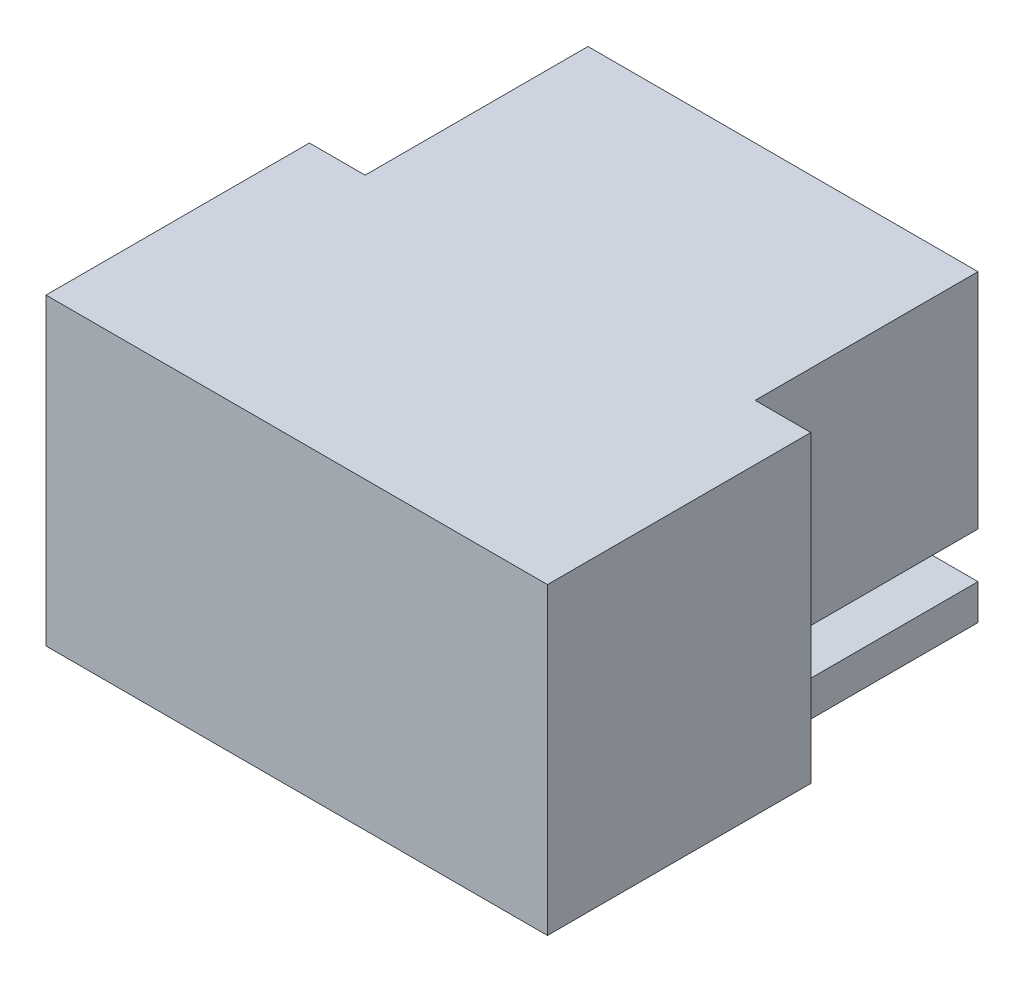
ISO-10303-21;
HEADER;
FILE_DESCRIPTION(('STEP AP214'),'2;1');
FILE_NAME('part.step','',(''),(''),'','','');
FILE_SCHEMA(('AUTOMOTIVE_DESIGN { 1 0 10303 214 1 1 1 1 }'));
ENDSEC;
DATA;
#1=APPLICATION_CONTEXT('core data for automotive mechanical design processes');
#2=APPLICATION_PROTOCOL_DEFINITION('international standard','automotive_design',2000,#1);
#3=PRODUCT_CONTEXT('',#1,'mechanical');
#4=PRODUCT('Part','Part','',(#3));
#5=PRODUCT_RELATED_PRODUCT_CATEGORY('part','',(#4));
#6=PRODUCT_DEFINITION_FORMATION('','',#4);
#7=PRODUCT_DEFINITION_CONTEXT('part definition',#1,'design');
#8=PRODUCT_DEFINITION('design','',#6,#7);
#9=PRODUCT_DEFINITION_SHAPE('','',#8);
#10=(LENGTH_UNIT() NAMED_UNIT(*) SI_UNIT(.MILLI.,.METRE.));
#11=(NAMED_UNIT(*) PLANE_ANGLE_UNIT() SI_UNIT($,.RADIAN.));
#12=(NAMED_UNIT(*) SI_UNIT($,.STERADIAN.) SOLID_ANGLE_UNIT());
#13=UNCERTAINTY_MEASURE_WITH_UNIT(LENGTH_MEASURE(1.E-05),#10,'distance_accuracy_value','');
#14=(GEOMETRIC_REPRESENTATION_CONTEXT(3) GLOBAL_UNCERTAINTY_ASSIGNED_CONTEXT((#13)) GLOBAL_UNIT_ASSIGNED_CONTEXT((#10,
#11,#12)) REPRESENTATION_CONTEXT('',''));
#15=CARTESIAN_POINT('',(0.,0.,0.));
#16=DIRECTION('',(0.,0.,1.));
#17=DIRECTION('',(1.,0.,0.));
#18=AXIS2_PLACEMENT_3D('',#15,#16,#17);
#19=CARTESIAN_POINT('',(-22.15,-25.085,-8.70710678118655));
#20=DIRECTION('',(1.,0.,0.));
#21=DIRECTION('',(0.,0.,-1.));
#22=AXIS2_PLACEMENT_3D('',#19,#20,#21);
#23=PLANE('',#22);
#24=DIRECTION('',(0.,0.,1.));
#25=VECTOR('',#24,1.);
#26=CARTESIAN_POINT('',(-22.15,-25.585,-8.70710678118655));
#27=LINE('',#26,#25);
#28=CARTESIAN_POINT('',(-22.15,-25.585,-6.7));
#29=VERTEX_POINT('',#28);
#30=CARTESIAN_POINT('',(-22.15,-25.585,-3.));
#31=VERTEX_POINT('',#30);
#32=EDGE_CURVE('E225',#29,#31,#27,.T.);
#33=ORIENTED_EDGE('',*,*,#32,.T.);
#34=DIRECTION('',(0.,1.,0.));
#35=VECTOR('',#34,1.);
#36=CARTESIAN_POINT('',(-22.15,-25.085,-3.));
#37=LINE('',#36,#35);
#38=CARTESIAN_POINT('',(-22.15,-25.085,-3.));
#39=VERTEX_POINT('',#38);
#40=EDGE_CURVE('E20',#39,#31,#37,.F.);
#41=ORIENTED_EDGE('',*,*,#40,.F.);
#42=DIRECTION('',(0.,0.,-1.));
#43=VECTOR('',#42,1.);
#44=CARTESIAN_POINT('',(-22.15,-25.085,-8.70710678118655));
#45=LINE('',#44,#43);
#46=CARTESIAN_POINT('',(-22.15,-25.085,-6.7));
#47=VERTEX_POINT('',#46);
#48=EDGE_CURVE('E243',#39,#47,#45,.T.);
#49=ORIENTED_EDGE('',*,*,#48,.T.);
#50=DIRECTION('',(0.,1.,0.));
#51=VECTOR('',#50,1.);
#52=CARTESIAN_POINT('',(-22.15,-25.085,-6.7));
#53=LINE('',#52,#51);
#54=EDGE_CURVE('E220',#29,#47,#53,.T.);
#55=ORIENTED_EDGE('',*,*,#54,.F.);
#56=EDGE_LOOP('',(#33,#41,#49,#55));
#57=FACE_BOUND('',#56,.T.);
#58=ADVANCED_FACE('F17',(#57),#23,.F.);
#59=CARTESIAN_POINT('',(-24.5,-25.085,-8.70710678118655));
#60=DIRECTION('',(1.,0.,0.));
#61=DIRECTION('',(0.,0.,-1.));
#62=AXIS2_PLACEMENT_3D('',#59,#60,#61);
#63=PLANE('',#62);
#64=DIRECTION('',(0.,0.,1.));
#65=VECTOR('',#64,1.);
#66=CARTESIAN_POINT('',(-24.5,-25.585,-8.70710678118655));
#67=LINE('',#66,#65);
#68=CARTESIAN_POINT('',(-24.5,-25.585,-6.7));
#69=VERTEX_POINT('',#68);
#70=CARTESIAN_POINT('',(-24.5,-25.585,-3.));
#71=VERTEX_POINT('',#70);
#72=EDGE_CURVE('E251',#69,#71,#67,.T.);
#73=ORIENTED_EDGE('',*,*,#72,.T.);
#74=DIRECTION('',(0.,1.,0.));
#75=VECTOR('',#74,1.);
#76=CARTESIAN_POINT('',(-24.5,-25.085,-3.));
#77=LINE('',#76,#75);
#78=CARTESIAN_POINT('',(-24.5,-25.085,-3.));
#79=VERTEX_POINT('',#78);
#80=EDGE_CURVE('E232',#79,#71,#77,.F.);
#81=ORIENTED_EDGE('',*,*,#80,.F.);
#82=DIRECTION('',(0.,0.,-1.));
#83=VECTOR('',#82,1.);
#84=CARTESIAN_POINT('',(-24.5,-25.085,-8.70710678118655));
#85=LINE('',#84,#83);
#86=CARTESIAN_POINT('',(-24.5,-25.085,-6.7));
#87=VERTEX_POINT('',#86);
#88=EDGE_CURVE('E261',#79,#87,#85,.T.);
#89=ORIENTED_EDGE('',*,*,#88,.T.);
#90=DIRECTION('',(0.,1.,0.));
#91=VECTOR('',#90,1.);
#92=CARTESIAN_POINT('',(-24.5,-25.085,-6.7));
#93=LINE('',#92,#91);
#94=EDGE_CURVE('E230',#69,#87,#93,.T.);
#95=ORIENTED_EDGE('',*,*,#94,.F.);
#96=EDGE_LOOP('',(#73,#81,#89,#95));
#97=FACE_BOUND('',#96,.T.);
#98=ADVANCED_FACE('F607',(#97),#63,.F.);
#99=CARTESIAN_POINT('',(-21.65,-25.585,-8.70710678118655));
#100=DIRECTION('',(0.,1.,0.));
#101=DIRECTION('',(0.,0.,1.));
#102=AXIS2_PLACEMENT_3D('',#99,#100,#101);
#103=PLANE('',#102);
#104=DIRECTION('',(0.,0.,1.));
#105=VECTOR('',#104,1.);
#106=CARTESIAN_POINT('',(-21.65,-25.585,-8.70710678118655));
#107=LINE('',#106,#105);
#108=CARTESIAN_POINT('',(-21.65,-25.585,-6.7));
#109=VERTEX_POINT('',#108);
#110=CARTESIAN_POINT('',(-21.65,-25.585,-3.));
#111=VERTEX_POINT('',#110);
#112=EDGE_CURVE('E227',#109,#111,#107,.T.);
#113=ORIENTED_EDGE('',*,*,#112,.T.);
#114=DIRECTION('',(1.,0.,0.));
#115=VECTOR('',#114,1.);
#116=CARTESIAN_POINT('',(-21.65,-25.585,-3.));
#117=LINE('',#116,#115);
#118=EDGE_CURVE('E217',#31,#111,#117,.T.);
#119=ORIENTED_EDGE('',*,*,#118,.F.);
#120=ORIENTED_EDGE('',*,*,#32,.F.);
#121=DIRECTION('',(-1.,0.,0.));
#122=VECTOR('',#121,1.);
#123=CARTESIAN_POINT('',(0.,-25.585,-6.7));
#124=LINE('',#123,#122);
#125=EDGE_CURVE('E242',#109,#29,#124,.T.);
#126=ORIENTED_EDGE('',*,*,#125,.F.);
#127=EDGE_LOOP('',(#113,#119,#120,#126));
#128=FACE_BOUND('',#127,.T.);
#129=ADVANCED_FACE('F223',(#128),#103,.F.);
#130=CARTESIAN_POINT('',(-21.65,-25.085,-8.70710678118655));
#131=DIRECTION('',(0.,-1.,0.));
#132=DIRECTION('',(0.,0.,-1.));
#133=AXIS2_PLACEMENT_3D('',#130,#131,#132);
#134=PLANE('',#133);
#135=ORIENTED_EDGE('',*,*,#48,.F.);
#136=DIRECTION('',(1.,0.,0.));
#137=VECTOR('',#136,1.);
#138=CARTESIAN_POINT('',(-21.65,-25.085,-3.));
#139=LINE('',#138,#137);
#140=CARTESIAN_POINT('',(-21.65,-25.085,-3.));
#141=VERTEX_POINT('',#140);
#142=EDGE_CURVE('E219',#141,#39,#139,.F.);
#143=ORIENTED_EDGE('',*,*,#142,.F.);
#144=DIRECTION('',(0.,0.,1.));
#145=VECTOR('',#144,1.);
#146=CARTESIAN_POINT('',(-21.65,-25.085,-8.70710678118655));
#147=LINE('',#146,#145);
#148=CARTESIAN_POINT('',(-21.65,-25.085,-6.7));
#149=VERTEX_POINT('',#148);
#150=EDGE_CURVE('E249',#141,#149,#147,.F.);
#151=ORIENTED_EDGE('',*,*,#150,.T.);
#152=DIRECTION('',(-1.,0.,0.));
#153=VECTOR('',#152,1.);
#154=CARTESIAN_POINT('',(0.,-25.085,-6.7));
#155=LINE('',#154,#153);
#156=EDGE_CURVE('E240',#47,#149,#155,.F.);
#157=ORIENTED_EDGE('',*,*,#156,.F.);
#158=EDGE_LOOP('',(#135,#143,#151,#157));
#159=FACE_BOUND('',#158,.T.);
#160=ADVANCED_FACE('F247',(#159),#134,.F.);
#161=CARTESIAN_POINT('',(0.,0.,-6.7));
#162=DIRECTION('',(0.,0.,-1.));
#163=DIRECTION('',(-1.,0.,0.));
#164=AXIS2_PLACEMENT_3D('',#161,#162,#163);
#165=PLANE('',#164);
#166=ORIENTED_EDGE('',*,*,#125,.T.);
#167=ORIENTED_EDGE('',*,*,#54,.T.);
#168=ORIENTED_EDGE('',*,*,#156,.T.);
#169=DIRECTION('',(0.,1.,0.));
#170=VECTOR('',#169,1.);
#171=CARTESIAN_POINT('',(-21.65,-25.085,-6.7));
#172=LINE('',#171,#170);
#173=EDGE_CURVE('E271',#149,#109,#172,.F.);
#174=ORIENTED_EDGE('',*,*,#173,.T.);
#175=EDGE_LOOP('',(#166,#167,#168,#174));
#176=FACE_BOUND('',#175,.T.);
#177=ADVANCED_FACE('F237',(#176),#165,.T.);
#178=CARTESIAN_POINT('',(-24.,-25.585,-8.70710678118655));
#179=DIRECTION('',(0.,1.,0.));
#180=DIRECTION('',(0.,0.,1.));
#181=AXIS2_PLACEMENT_3D('',#178,#179,#180);
#182=PLANE('',#181);
#183=DIRECTION('',(0.,0.,1.));
#184=VECTOR('',#183,1.);
#185=CARTESIAN_POINT('',(-24.,-25.585,-8.70710678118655));
#186=LINE('',#185,#184);
#187=CARTESIAN_POINT('',(-24.,-25.585,-6.7));
#188=VERTEX_POINT('',#187);
#189=CARTESIAN_POINT('',(-24.,-25.585,-3.));
#190=VERTEX_POINT('',#189);
#191=EDGE_CURVE('E273',#188,#190,#186,.T.);
#192=ORIENTED_EDGE('',*,*,#191,.T.);
#193=DIRECTION('',(1.,0.,0.));
#194=VECTOR('',#193,1.);
#195=CARTESIAN_POINT('',(-24.,-25.585,-3.));
#196=LINE('',#195,#194);
#197=EDGE_CURVE('E256',#71,#190,#196,.T.);
#198=ORIENTED_EDGE('',*,*,#197,.F.);
#199=ORIENTED_EDGE('',*,*,#72,.F.);
#200=DIRECTION('',(-1.,0.,0.));
#201=VECTOR('',#200,1.);
#202=CARTESIAN_POINT('',(0.,-25.585,-6.7));
#203=LINE('',#202,#201);
#204=EDGE_CURVE('E266',#188,#69,#203,.T.);
#205=ORIENTED_EDGE('',*,*,#204,.F.);
#206=EDGE_LOOP('',(#192,#198,#199,#205));
#207=FACE_BOUND('',#206,.T.);
#208=ADVANCED_FACE('F597',(#207),#182,.F.);
#209=CARTESIAN_POINT('',(-24.,-25.085,-8.70710678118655));
#210=DIRECTION('',(0.,-1.,0.));
#211=DIRECTION('',(0.,0.,-1.));
#212=AXIS2_PLACEMENT_3D('',#209,#210,#211);
#213=PLANE('',#212);
#214=ORIENTED_EDGE('',*,*,#88,.F.);
#215=DIRECTION('',(1.,0.,0.));
#216=VECTOR('',#215,1.);
#217=CARTESIAN_POINT('',(-24.,-25.085,-3.));
#218=LINE('',#217,#216);
#219=CARTESIAN_POINT('',(-24.,-25.085,-3.));
#220=VERTEX_POINT('',#219);
#221=EDGE_CURVE('E258',#220,#79,#218,.F.);
#222=ORIENTED_EDGE('',*,*,#221,.F.);
#223=DIRECTION('',(0.,0.,1.));
#224=VECTOR('',#223,1.);
#225=CARTESIAN_POINT('',(-24.,-25.085,-8.70710678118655));
#226=LINE('',#225,#224);
#227=CARTESIAN_POINT('',(-24.,-25.085,-6.7));
#228=VERTEX_POINT('',#227);
#229=EDGE_CURVE('E276',#220,#228,#226,.F.);
#230=ORIENTED_EDGE('',*,*,#229,.T.);
#231=DIRECTION('',(-1.,0.,0.));
#232=VECTOR('',#231,1.);
#233=CARTESIAN_POINT('',(0.,-25.085,-6.7));
#234=LINE('',#233,#232);
#235=EDGE_CURVE('E264',#87,#228,#234,.F.);
#236=ORIENTED_EDGE('',*,*,#235,.F.);
#237=EDGE_LOOP('',(#214,#222,#230,#236));
#238=FACE_BOUND('',#237,.T.);
#239=ADVANCED_FACE('F593',(#238),#213,.F.);
#240=CARTESIAN_POINT('',(0.,0.,-6.7));
#241=DIRECTION('',(0.,0.,-1.));
#242=DIRECTION('',(-1.,0.,0.));
#243=AXIS2_PLACEMENT_3D('',#240,#241,#242);
#244=PLANE('',#243);
#245=ORIENTED_EDGE('',*,*,#204,.T.);
#246=ORIENTED_EDGE('',*,*,#94,.T.);
#247=ORIENTED_EDGE('',*,*,#235,.T.);
#248=DIRECTION('',(0.,1.,0.));
#249=VECTOR('',#248,1.);
#250=CARTESIAN_POINT('',(-24.,-25.085,-6.7));
#251=LINE('',#250,#249);
#252=EDGE_CURVE('E279',#228,#188,#251,.F.);
#253=ORIENTED_EDGE('',*,*,#252,.T.);
#254=EDGE_LOOP('',(#245,#246,#247,#253));
#255=FACE_BOUND('',#254,.T.);
#256=ADVANCED_FACE('F589',(#255),#244,.T.);
#257=CARTESIAN_POINT('',(-21.65,-25.085,-8.70710678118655));
#258=DIRECTION('',(-1.,0.,0.));
#259=DIRECTION('',(0.,0.,1.));
#260=AXIS2_PLACEMENT_3D('',#257,#258,#259);
#261=PLANE('',#260);
#262=ORIENTED_EDGE('',*,*,#150,.F.);
#263=DIRECTION('',(0.,1.,0.));
#264=VECTOR('',#263,1.);
#265=CARTESIAN_POINT('',(-21.65,0.,-3.));
#266=LINE('',#265,#264);
#267=EDGE_CURVE('E304',#141,#111,#266,.F.);
#268=ORIENTED_EDGE('',*,*,#267,.T.);
#269=ORIENTED_EDGE('',*,*,#112,.F.);
#270=ORIENTED_EDGE('',*,*,#173,.F.);
#271=EDGE_LOOP('',(#262,#268,#269,#270));
#272=FACE_BOUND('',#271,.T.);
#273=ADVANCED_FACE('F585',(#272),#261,.F.);
#274=CARTESIAN_POINT('',(-19.9534322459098,-26.485,-3.));
#275=DIRECTION('',(0.,-1.,0.));
#276=DIRECTION('',(0.,0.,-1.));
#277=AXIS2_PLACEMENT_3D('',#274,#275,#276);
#278=PLANE('',#277);
#279=DIRECTION('',(0.,0.,-1.));
#280=VECTOR('',#279,1.);
#281=CARTESIAN_POINT('',(-21.15,-26.485,-3.));
#282=LINE('',#281,#280);
#283=CARTESIAN_POINT('',(-21.15,-26.485,-8.));
#284=VERTEX_POINT('',#283);
#285=CARTESIAN_POINT('',(-21.15,-26.485,-3.));
#286=VERTEX_POINT('',#285);
#287=EDGE_CURVE('E299',#284,#286,#282,.F.);
#288=ORIENTED_EDGE('',*,*,#287,.T.);
#289=DIRECTION('',(1.,0.,0.));
#290=VECTOR('',#289,1.);
#291=CARTESIAN_POINT('',(0.,-26.485,-3.));
#292=LINE('',#291,#290);
#293=CARTESIAN_POINT('',(-19.1,-26.485,-3.));
#294=VERTEX_POINT('',#293);
#295=EDGE_CURVE('E311',#286,#294,#292,.T.);
#296=ORIENTED_EDGE('',*,*,#295,.T.);
#297=DIRECTION('',(0.,0.,-1.));
#298=VECTOR('',#297,1.);
#299=CARTESIAN_POINT('',(-19.1,-26.485,-3.));
#300=LINE('',#299,#298);
#301=CARTESIAN_POINT('',(-19.1,-26.485,-3.6));
#302=VERTEX_POINT('',#301);
#303=EDGE_CURVE('E284',#294,#302,#300,.T.);
#304=ORIENTED_EDGE('',*,*,#303,.T.);
#305=DIRECTION('',(0.,0.,1.));
#306=VECTOR('',#305,1.);
#307=CARTESIAN_POINT('',(-19.1,-26.485,-3.6));
#308=LINE('',#307,#306);
#309=CARTESIAN_POINT('',(-19.1,-26.485,-8.));
#310=VERTEX_POINT('',#309);
#311=EDGE_CURVE('E292',#302,#310,#308,.F.);
#312=ORIENTED_EDGE('',*,*,#311,.T.);
#313=DIRECTION('',(-1.,0.,0.));
#314=VECTOR('',#313,1.);
#315=CARTESIAN_POINT('',(0.,-26.485,-8.));
#316=LINE('',#315,#314);
#317=EDGE_CURVE('E295',#284,#310,#316,.F.);
#318=ORIENTED_EDGE('',*,*,#317,.F.);
#319=EDGE_LOOP('',(#288,#296,#304,#312,#318));
#320=FACE_BOUND('',#319,.T.);
#321=ADVANCED_FACE('F581',(#320),#278,.F.);
#322=CARTESIAN_POINT('',(-24.,-25.085,-8.70710678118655));
#323=DIRECTION('',(-1.,0.,0.));
#324=DIRECTION('',(0.,0.,1.));
#325=AXIS2_PLACEMENT_3D('',#322,#323,#324);
#326=PLANE('',#325);
#327=ORIENTED_EDGE('',*,*,#229,.F.);
#328=DIRECTION('',(0.,1.,0.));
#329=VECTOR('',#328,1.);
#330=CARTESIAN_POINT('',(-24.,0.,-3.));
#331=LINE('',#330,#329);
#332=EDGE_CURVE('E316',#220,#190,#331,.F.);
#333=ORIENTED_EDGE('',*,*,#332,.T.);
#334=ORIENTED_EDGE('',*,*,#191,.F.);
#335=ORIENTED_EDGE('',*,*,#252,.F.);
#336=EDGE_LOOP('',(#327,#333,#334,#335));
#337=FACE_BOUND('',#336,.T.);
#338=ADVANCED_FACE('F577',(#337),#326,.F.);
#339=CARTESIAN_POINT('',(-25.9465677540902,-26.485,-3.));
#340=DIRECTION('',(0.,-1.,0.));
#341=DIRECTION('',(0.,0.,-1.));
#342=AXIS2_PLACEMENT_3D('',#339,#340,#341);
#343=PLANE('',#342);
#344=DIRECTION('',(0.,0.,-1.));
#345=VECTOR('',#344,1.);
#346=CARTESIAN_POINT('',(-26.8,-26.485,-3.6));
#347=LINE('',#346,#345);
#348=CARTESIAN_POINT('',(-26.8,-26.485,-8.));
#349=VERTEX_POINT('',#348);
#350=CARTESIAN_POINT('',(-26.8,-26.485,-3.6));
#351=VERTEX_POINT('',#350);
#352=EDGE_CURVE('E287',#349,#351,#347,.F.);
#353=ORIENTED_EDGE('',*,*,#352,.T.);
#354=DIRECTION('',(0.,0.,-1.));
#355=VECTOR('',#354,1.);
#356=CARTESIAN_POINT('',(-26.8,-26.485,-3.));
#357=LINE('',#356,#355);
#358=CARTESIAN_POINT('',(-26.8,-26.485,-3.));
#359=VERTEX_POINT('',#358);
#360=EDGE_CURVE('E282',#359,#351,#357,.T.);
#361=ORIENTED_EDGE('',*,*,#360,.F.);
#362=DIRECTION('',(1.,0.,0.));
#363=VECTOR('',#362,1.);
#364=CARTESIAN_POINT('',(0.,-26.485,-3.));
#365=LINE('',#364,#363);
#366=CARTESIAN_POINT('',(-24.75,-26.485,-3.));
#367=VERTEX_POINT('',#366);
#368=EDGE_CURVE('E306',#359,#367,#365,.T.);
#369=ORIENTED_EDGE('',*,*,#368,.T.);
#370=DIRECTION('',(0.,0.,1.));
#371=VECTOR('',#370,1.);
#372=CARTESIAN_POINT('',(-24.75,-26.485,-3.));
#373=LINE('',#372,#371);
#374=CARTESIAN_POINT('',(-24.75,-26.485,-8.));
#375=VERTEX_POINT('',#374);
#376=EDGE_CURVE('E322',#367,#375,#373,.F.);
#377=ORIENTED_EDGE('',*,*,#376,.T.);
#378=DIRECTION('',(-1.,0.,0.));
#379=VECTOR('',#378,1.);
#380=CARTESIAN_POINT('',(0.,-26.485,-8.));
#381=LINE('',#380,#379);
#382=EDGE_CURVE('E325',#349,#375,#381,.F.);
#383=ORIENTED_EDGE('',*,*,#382,.F.);
#384=EDGE_LOOP('',(#353,#361,#369,#377,#383));
#385=FACE_BOUND('',#384,.T.);
#386=ADVANCED_FACE('F573',(#385),#343,.F.);
#387=CARTESIAN_POINT('',(-19.1,-25.585,-3.));
#388=DIRECTION('',(1.,0.,0.));
#389=DIRECTION('',(0.,0.,-1.));
#390=AXIS2_PLACEMENT_3D('',#387,#388,#389);
#391=PLANE('',#390);
#392=ORIENTED_EDGE('',*,*,#303,.F.);
#393=DIRECTION('',(0.,1.,0.));
#394=VECTOR('',#393,1.);
#395=CARTESIAN_POINT('',(-19.1,0.,-3.));
#396=LINE('',#395,#394);
#397=CARTESIAN_POINT('',(-19.1,-25.585,-3.));
#398=VERTEX_POINT('',#397);
#399=EDGE_CURVE('E314',#294,#398,#396,.T.);
#400=ORIENTED_EDGE('',*,*,#399,.T.);
#401=DIRECTION('',(0.,0.,1.));
#402=VECTOR('',#401,1.);
#403=CARTESIAN_POINT('',(-19.1,-25.585,-3.));
#404=LINE('',#403,#402);
#405=CARTESIAN_POINT('',(-19.1,-25.585,-3.6));
#406=VERTEX_POINT('',#405);
#407=EDGE_CURVE('E364',#398,#406,#404,.F.);
#408=ORIENTED_EDGE('',*,*,#407,.T.);
#409=DIRECTION('',(0.,1.,0.));
#410=VECTOR('',#409,1.);
#411=CARTESIAN_POINT('',(-19.1,0.,-3.6));
#412=LINE('',#411,#410);
#413=EDGE_CURVE('E370',#302,#406,#412,.T.);
#414=ORIENTED_EDGE('',*,*,#413,.F.);
#415=EDGE_LOOP('',(#392,#400,#408,#414));
#416=FACE_BOUND('',#415,.T.);
#417=ADVANCED_FACE('F569',(#416),#391,.F.);
#418=CARTESIAN_POINT('',(-26.8,-21.185,-3.6));
#419=DIRECTION('',(1.,0.,0.));
#420=DIRECTION('',(0.,0.,-1.));
#421=AXIS2_PLACEMENT_3D('',#418,#419,#420);
#422=PLANE('',#421);
#423=ORIENTED_EDGE('',*,*,#352,.F.);
#424=DIRECTION('',(0.,1.,0.));
#425=VECTOR('',#424,1.);
#426=CARTESIAN_POINT('',(-26.8,0.,-8.));
#427=LINE('',#426,#425);
#428=CARTESIAN_POINT('',(-26.8,-27.185,-8.));
#429=VERTEX_POINT('',#428);
#430=EDGE_CURVE('E329',#429,#349,#427,.T.);
#431=ORIENTED_EDGE('',*,*,#430,.F.);
#432=DIRECTION('',(0.,0.,1.));
#433=VECTOR('',#432,1.);
#434=CARTESIAN_POINT('',(-26.8,-27.185,-8.));
#435=LINE('',#434,#433);
#436=CARTESIAN_POINT('',(-26.8,-27.185,-3.6));
#437=VERTEX_POINT('',#436);
#438=EDGE_CURVE('E374',#429,#437,#435,.T.);
#439=ORIENTED_EDGE('',*,*,#438,.T.);
#440=DIRECTION('',(0.,1.,0.));
#441=VECTOR('',#440,1.);
#442=CARTESIAN_POINT('',(-26.8,-21.185,-3.6));
#443=LINE('',#442,#441);
#444=EDGE_CURVE('E290',#351,#437,#443,.F.);
#445=ORIENTED_EDGE('',*,*,#444,.F.);
#446=EDGE_LOOP('',(#423,#431,#439,#445));
#447=FACE_BOUND('',#446,.T.);
#448=ADVANCED_FACE('F565',(#447),#422,.F.);
#449=CARTESIAN_POINT('',(-19.1,-21.185,-3.6));
#450=DIRECTION('',(-1.,0.,0.));
#451=DIRECTION('',(0.,0.,1.));
#452=AXIS2_PLACEMENT_3D('',#449,#450,#451);
#453=PLANE('',#452);
#454=ORIENTED_EDGE('',*,*,#311,.F.);
#455=DIRECTION('',(0.,1.,0.));
#456=VECTOR('',#455,1.);
#457=CARTESIAN_POINT('',(-19.1,0.,-3.6));
#458=LINE('',#457,#456);
#459=CARTESIAN_POINT('',(-19.1,-27.185,-3.6));
#460=VERTEX_POINT('',#459);
#461=EDGE_CURVE('E367',#460,#302,#458,.T.);
#462=ORIENTED_EDGE('',*,*,#461,.F.);
#463=DIRECTION('',(0.,0.,1.));
#464=VECTOR('',#463,1.);
#465=CARTESIAN_POINT('',(-19.1,-27.185,-8.));
#466=LINE('',#465,#464);
#467=CARTESIAN_POINT('',(-19.1,-27.185,-8.));
#468=VERTEX_POINT('',#467);
#469=EDGE_CURVE('E380',#460,#468,#466,.F.);
#470=ORIENTED_EDGE('',*,*,#469,.T.);
#471=DIRECTION('',(0.,1.,0.));
#472=VECTOR('',#471,1.);
#473=CARTESIAN_POINT('',(-19.1,0.,-8.));
#474=LINE('',#473,#472);
#475=EDGE_CURVE('E297',#310,#468,#474,.F.);
#476=ORIENTED_EDGE('',*,*,#475,.F.);
#477=EDGE_LOOP('',(#454,#462,#470,#476));
#478=FACE_BOUND('',#477,.T.);
#479=ADVANCED_FACE('F561',(#478),#453,.F.);
#480=CARTESIAN_POINT('',(0.,0.,-8.));
#481=DIRECTION('',(0.,0.,-1.));
#482=DIRECTION('',(-1.,0.,0.));
#483=AXIS2_PLACEMENT_3D('',#480,#481,#482);
#484=PLANE('',#483);
#485=ORIENTED_EDGE('',*,*,#475,.T.);
#486=DIRECTION('',(1.,0.,0.));
#487=VECTOR('',#486,1.);
#488=CARTESIAN_POINT('',(-18.,-27.185,-8.));
#489=LINE('',#488,#487);
#490=CARTESIAN_POINT('',(-21.15,-27.185,-8.));
#491=VERTEX_POINT('',#490);
#492=EDGE_CURVE('E383',#468,#491,#489,.F.);
#493=ORIENTED_EDGE('',*,*,#492,.T.);
#494=DIRECTION('',(0.,1.,0.));
#495=VECTOR('',#494,1.);
#496=CARTESIAN_POINT('',(-21.15,-26.485,-8.));
#497=LINE('',#496,#495);
#498=EDGE_CURVE('E301',#491,#284,#497,.T.);
#499=ORIENTED_EDGE('',*,*,#498,.T.);
#500=ORIENTED_EDGE('',*,*,#317,.T.);
#501=EDGE_LOOP('',(#485,#493,#499,#500));
#502=FACE_BOUND('',#501,.T.);
#503=ADVANCED_FACE('F557',(#502),#484,.T.);
#504=CARTESIAN_POINT('',(-21.15,-26.485,-3.));
#505=DIRECTION('',(1.,0.,0.));
#506=DIRECTION('',(0.,0.,-1.));
#507=AXIS2_PLACEMENT_3D('',#504,#505,#506);
#508=PLANE('',#507);
#509=DIRECTION('',(0.,0.,1.));
#510=VECTOR('',#509,1.);
#511=CARTESIAN_POINT('',(-21.15,-27.185,-8.));
#512=LINE('',#511,#510);
#513=CARTESIAN_POINT('',(-21.15,-27.185,-3.));
#514=VERTEX_POINT('',#513);
#515=EDGE_CURVE('E386',#491,#514,#512,.T.);
#516=ORIENTED_EDGE('',*,*,#515,.T.);
#517=DIRECTION('',(0.,1.,0.));
#518=VECTOR('',#517,1.);
#519=CARTESIAN_POINT('',(-21.15,0.,-3.));
#520=LINE('',#519,#518);
#521=EDGE_CURVE('E308',#514,#286,#520,.T.);
#522=ORIENTED_EDGE('',*,*,#521,.T.);
#523=ORIENTED_EDGE('',*,*,#287,.F.);
#524=ORIENTED_EDGE('',*,*,#498,.F.);
#525=EDGE_LOOP('',(#516,#522,#523,#524));
#526=FACE_BOUND('',#525,.T.);
#527=ADVANCED_FACE('F553',(#526),#508,.F.);
#528=CARTESIAN_POINT('',(0.,0.,-3.));
#529=DIRECTION('',(0.,0.,1.));
#530=DIRECTION('',(1.,0.,0.));
#531=AXIS2_PLACEMENT_3D('',#528,#529,#530);
#532=PLANE('',#531);
#533=ORIENTED_EDGE('',*,*,#221,.T.);
#534=ORIENTED_EDGE('',*,*,#80,.T.);
#535=ORIENTED_EDGE('',*,*,#197,.T.);
#536=ORIENTED_EDGE('',*,*,#332,.F.);
#537=EDGE_LOOP('',(#533,#534,#535,#536));
#538=FACE_BOUND('',#537,.T.);
#539=DIRECTION('',(0.,1.,0.));
#540=VECTOR('',#539,1.);
#541=CARTESIAN_POINT('',(-19.8,-21.885,-3.));
#542=LINE('',#541,#540);
#543=CARTESIAN_POINT('',(-19.8,-21.885,-3.));
#544=VERTEX_POINT('',#543);
#545=CARTESIAN_POINT('',(-19.8,-25.585,-3.));
#546=VERTEX_POINT('',#545);
#547=EDGE_CURVE('E341',#544,#546,#542,.F.);
#548=ORIENTED_EDGE('',*,*,#547,.T.);
#549=DIRECTION('',(1.,0.,0.));
#550=VECTOR('',#549,1.);
#551=CARTESIAN_POINT('',(-19.1,-25.585,-3.));
#552=LINE('',#551,#550);
#553=EDGE_CURVE('E361',#546,#398,#552,.T.);
#554=ORIENTED_EDGE('',*,*,#553,.T.);
#555=ORIENTED_EDGE('',*,*,#399,.F.);
#556=ORIENTED_EDGE('',*,*,#295,.F.);
#557=ORIENTED_EDGE('',*,*,#521,.F.);
#558=DIRECTION('',(1.,0.,0.));
#559=VECTOR('',#558,1.);
#560=CARTESIAN_POINT('',(-18.,-27.185,-3.));
#561=LINE('',#560,#559);
#562=CARTESIAN_POINT('',(-24.75,-27.185,-3.));
#563=VERTEX_POINT('',#562);
#564=EDGE_CURVE('E389',#514,#563,#561,.F.);
#565=ORIENTED_EDGE('',*,*,#564,.T.);
#566=DIRECTION('',(0.,1.,0.));
#567=VECTOR('',#566,1.);
#568=CARTESIAN_POINT('',(-24.75,-26.485,-3.));
#569=LINE('',#568,#567);
#570=EDGE_CURVE('E319',#563,#367,#569,.T.);
#571=ORIENTED_EDGE('',*,*,#570,.T.);
#572=ORIENTED_EDGE('',*,*,#368,.F.);
#573=DIRECTION('',(0.,1.,0.));
#574=VECTOR('',#573,1.);
#575=CARTESIAN_POINT('',(-26.8,-26.485,-3.));
#576=LINE('',#575,#574);
#577=CARTESIAN_POINT('',(-26.8,-25.585,-3.));
#578=VERTEX_POINT('',#577);
#579=EDGE_CURVE('E332',#359,#578,#576,.T.);
#580=ORIENTED_EDGE('',*,*,#579,.T.);
#581=DIRECTION('',(1.,0.,0.));
#582=VECTOR('',#581,1.);
#583=CARTESIAN_POINT('',(-26.1,-25.585,-3.));
#584=LINE('',#583,#582);
#585=CARTESIAN_POINT('',(-26.1,-25.585,-3.));
#586=VERTEX_POINT('',#585);
#587=EDGE_CURVE('E337',#578,#586,#584,.T.);
#588=ORIENTED_EDGE('',*,*,#587,.T.);
#589=DIRECTION('',(0.,1.,0.));
#590=VECTOR('',#589,1.);
#591=CARTESIAN_POINT('',(-26.1,-21.885,-3.));
#592=LINE('',#591,#590);
#593=CARTESIAN_POINT('',(-26.1,-21.885,-3.));
#594=VERTEX_POINT('',#593);
#595=EDGE_CURVE('E352',#586,#594,#592,.T.);
#596=ORIENTED_EDGE('',*,*,#595,.T.);
#597=DIRECTION('',(1.,0.,0.));
#598=VECTOR('',#597,1.);
#599=CARTESIAN_POINT('',(-19.8,-21.885,-3.));
#600=LINE('',#599,#598);
#601=EDGE_CURVE('E343',#594,#544,#600,.T.);
#602=ORIENTED_EDGE('',*,*,#601,.T.);
#603=EDGE_LOOP('',(#548,#554,#555,#556,#557,#565,#571,#572,#580,#588,#596,#602));
#604=FACE_BOUND('',#603,.T.);
#605=ORIENTED_EDGE('',*,*,#142,.T.);
#606=ORIENTED_EDGE('',*,*,#40,.T.);
#607=ORIENTED_EDGE('',*,*,#118,.T.);
#608=ORIENTED_EDGE('',*,*,#267,.F.);
#609=EDGE_LOOP('',(#605,#606,#607,#608));
#610=FACE_BOUND('',#609,.T.);
#611=ADVANCED_FACE('F215',(#538,#604,#610),#532,.F.);
#612=CARTESIAN_POINT('',(-24.75,-26.485,-3.));
#613=DIRECTION('',(-1.,0.,0.));
#614=DIRECTION('',(0.,0.,1.));
#615=AXIS2_PLACEMENT_3D('',#612,#613,#614);
#616=PLANE('',#615);
#617=ORIENTED_EDGE('',*,*,#376,.F.);
#618=ORIENTED_EDGE('',*,*,#570,.F.);
#619=DIRECTION('',(0.,0.,1.));
#620=VECTOR('',#619,1.);
#621=CARTESIAN_POINT('',(-24.75,-27.185,-8.));
#622=LINE('',#621,#620);
#623=CARTESIAN_POINT('',(-24.75,-27.185,-8.));
#624=VERTEX_POINT('',#623);
#625=EDGE_CURVE('E392',#563,#624,#622,.F.);
#626=ORIENTED_EDGE('',*,*,#625,.T.);
#627=DIRECTION('',(0.,1.,0.));
#628=VECTOR('',#627,1.);
#629=CARTESIAN_POINT('',(-24.75,0.,-8.));
#630=LINE('',#629,#628);
#631=EDGE_CURVE('E327',#375,#624,#630,.F.);
#632=ORIENTED_EDGE('',*,*,#631,.F.);
#633=EDGE_LOOP('',(#617,#618,#626,#632));
#634=FACE_BOUND('',#633,.T.);
#635=ADVANCED_FACE('F546',(#634),#616,.F.);
#636=CARTESIAN_POINT('',(0.,0.,-8.));
#637=DIRECTION('',(0.,0.,-1.));
#638=DIRECTION('',(-1.,0.,0.));
#639=AXIS2_PLACEMENT_3D('',#636,#637,#638);
#640=PLANE('',#639);
#641=DIRECTION('',(1.,0.,0.));
#642=VECTOR('',#641,1.);
#643=CARTESIAN_POINT('',(-18.,-27.185,-8.));
#644=LINE('',#643,#642);
#645=EDGE_CURVE('E395',#624,#429,#644,.F.);
#646=ORIENTED_EDGE('',*,*,#645,.T.);
#647=ORIENTED_EDGE('',*,*,#430,.T.);
#648=ORIENTED_EDGE('',*,*,#382,.T.);
#649=ORIENTED_EDGE('',*,*,#631,.T.);
#650=EDGE_LOOP('',(#646,#647,#648,#649));
#651=FACE_BOUND('',#650,.T.);
#652=ADVANCED_FACE('F542',(#651),#640,.T.);
#653=CARTESIAN_POINT('',(-26.8,-26.485,-3.));
#654=DIRECTION('',(-1.,0.,0.));
#655=DIRECTION('',(0.,0.,1.));
#656=AXIS2_PLACEMENT_3D('',#653,#654,#655);
#657=PLANE('',#656);
#658=ORIENTED_EDGE('',*,*,#579,.F.);
#659=ORIENTED_EDGE('',*,*,#360,.T.);
#660=DIRECTION('',(0.,1.,0.));
#661=VECTOR('',#660,1.);
#662=CARTESIAN_POINT('',(-26.8,0.,-3.6));
#663=LINE('',#662,#661);
#664=CARTESIAN_POINT('',(-26.8,-25.585,-3.6));
#665=VERTEX_POINT('',#664);
#666=EDGE_CURVE('E401',#351,#665,#663,.T.);
#667=ORIENTED_EDGE('',*,*,#666,.T.);
#668=DIRECTION('',(0.,0.,1.));
#669=VECTOR('',#668,1.);
#670=CARTESIAN_POINT('',(-26.8,-25.585,-3.));
#671=LINE('',#670,#669);
#672=EDGE_CURVE('E334',#665,#578,#671,.T.);
#673=ORIENTED_EDGE('',*,*,#672,.T.);
#674=EDGE_LOOP('',(#658,#659,#667,#673));
#675=FACE_BOUND('',#674,.T.);
#676=ADVANCED_FACE('F538',(#675),#657,.F.);
#677=CARTESIAN_POINT('',(-26.1,-25.585,-3.));
#678=DIRECTION('',(0.,1.,0.));
#679=DIRECTION('',(0.,0.,1.));
#680=AXIS2_PLACEMENT_3D('',#677,#678,#679);
#681=PLANE('',#680);
#682=DIRECTION('',(0.,0.,1.));
#683=VECTOR('',#682,1.);
#684=CARTESIAN_POINT('',(-26.1,-25.585,-3.));
#685=LINE('',#684,#683);
#686=CARTESIAN_POINT('',(-26.1,-25.585,-8.));
#687=VERTEX_POINT('',#686);
#688=EDGE_CURVE('E349',#687,#586,#685,.T.);
#689=ORIENTED_EDGE('',*,*,#688,.T.);
#690=ORIENTED_EDGE('',*,*,#587,.F.);
#691=ORIENTED_EDGE('',*,*,#672,.F.);
#692=DIRECTION('',(0.,0.,-1.));
#693=VECTOR('',#692,1.);
#694=CARTESIAN_POINT('',(-26.8,-25.585,-3.6));
#695=LINE('',#694,#693);
#696=CARTESIAN_POINT('',(-26.8,-25.585,-8.));
#697=VERTEX_POINT('',#696);
#698=EDGE_CURVE('E409',#665,#697,#695,.T.);
#699=ORIENTED_EDGE('',*,*,#698,.T.);
#700=DIRECTION('',(1.,0.,0.));
#701=VECTOR('',#700,1.);
#702=CARTESIAN_POINT('',(-26.1,-25.585,-8.));
#703=LINE('',#702,#701);
#704=EDGE_CURVE('E339',#687,#697,#703,.F.);
#705=ORIENTED_EDGE('',*,*,#704,.F.);
#706=EDGE_LOOP('',(#689,#690,#691,#699,#705));
#707=FACE_BOUND('',#706,.T.);
#708=ADVANCED_FACE('F534',(#707),#681,.F.);
#709=CARTESIAN_POINT('',(-19.8,-21.885,-3.));
#710=DIRECTION('',(1.,0.,0.));
#711=DIRECTION('',(0.,0.,-1.));
#712=AXIS2_PLACEMENT_3D('',#709,#710,#711);
#713=PLANE('',#712);
#714=DIRECTION('',(0.,0.,1.));
#715=VECTOR('',#714,1.);
#716=CARTESIAN_POINT('',(-19.8,-25.585,-3.));
#717=LINE('',#716,#715);
#718=CARTESIAN_POINT('',(-19.8,-25.585,-8.));
#719=VERTEX_POINT('',#718);
#720=EDGE_CURVE('E358',#719,#546,#717,.T.);
#721=ORIENTED_EDGE('',*,*,#720,.T.);
#722=ORIENTED_EDGE('',*,*,#547,.F.);
#723=DIRECTION('',(0.,0.,1.));
#724=VECTOR('',#723,1.);
#725=CARTESIAN_POINT('',(-19.8,-21.885,-3.));
#726=LINE('',#725,#724);
#727=CARTESIAN_POINT('',(-19.8,-21.885,-8.));
#728=VERTEX_POINT('',#727);
#729=EDGE_CURVE('E346',#544,#728,#726,.F.);
#730=ORIENTED_EDGE('',*,*,#729,.T.);
#731=DIRECTION('',(0.,1.,0.));
#732=VECTOR('',#731,1.);
#733=CARTESIAN_POINT('',(-19.8,0.,-8.));
#734=LINE('',#733,#732);
#735=EDGE_CURVE('E417',#719,#728,#734,.T.);
#736=ORIENTED_EDGE('',*,*,#735,.F.);
#737=EDGE_LOOP('',(#721,#722,#730,#736));
#738=FACE_BOUND('',#737,.T.);
#739=ADVANCED_FACE('F530',(#738),#713,.F.);
#740=CARTESIAN_POINT('',(-19.8,-21.885,-3.));
#741=DIRECTION('',(0.,1.,0.));
#742=DIRECTION('',(0.,0.,1.));
#743=AXIS2_PLACEMENT_3D('',#740,#741,#742);
#744=PLANE('',#743);
#745=ORIENTED_EDGE('',*,*,#729,.F.);
#746=ORIENTED_EDGE('',*,*,#601,.F.);
#747=DIRECTION('',(0.,0.,1.));
#748=VECTOR('',#747,1.);
#749=CARTESIAN_POINT('',(-26.1,-21.885,-3.));
#750=LINE('',#749,#748);
#751=CARTESIAN_POINT('',(-26.1,-21.885,-8.));
#752=VERTEX_POINT('',#751);
#753=EDGE_CURVE('E355',#594,#752,#750,.F.);
#754=ORIENTED_EDGE('',*,*,#753,.T.);
#755=DIRECTION('',(-1.,0.,0.));
#756=VECTOR('',#755,1.);
#757=CARTESIAN_POINT('',(0.,-21.885,-8.));
#758=LINE('',#757,#756);
#759=EDGE_CURVE('E419',#728,#752,#758,.T.);
#760=ORIENTED_EDGE('',*,*,#759,.F.);
#761=EDGE_LOOP('',(#745,#746,#754,#760));
#762=FACE_BOUND('',#761,.T.);
#763=ADVANCED_FACE('F526',(#762),#744,.F.);
#764=CARTESIAN_POINT('',(-26.1,-21.885,-3.));
#765=DIRECTION('',(-1.,0.,0.));
#766=DIRECTION('',(0.,0.,1.));
#767=AXIS2_PLACEMENT_3D('',#764,#765,#766);
#768=PLANE('',#767);
#769=ORIENTED_EDGE('',*,*,#753,.F.);
#770=ORIENTED_EDGE('',*,*,#595,.F.);
#771=ORIENTED_EDGE('',*,*,#688,.F.);
#772=DIRECTION('',(0.,1.,0.));
#773=VECTOR('',#772,1.);
#774=CARTESIAN_POINT('',(-26.1,0.,-8.));
#775=LINE('',#774,#773);
#776=EDGE_CURVE('E421',#752,#687,#775,.F.);
#777=ORIENTED_EDGE('',*,*,#776,.F.);
#778=EDGE_LOOP('',(#769,#770,#771,#777));
#779=FACE_BOUND('',#778,.T.);
#780=ADVANCED_FACE('F522',(#779),#768,.F.);
#781=CARTESIAN_POINT('',(-19.1,-25.585,-3.));
#782=DIRECTION('',(0.,1.,0.));
#783=DIRECTION('',(0.,0.,1.));
#784=AXIS2_PLACEMENT_3D('',#781,#782,#783);
#785=PLANE('',#784);
#786=DIRECTION('',(0.,0.,1.));
#787=VECTOR('',#786,1.);
#788=CARTESIAN_POINT('',(-19.1,-25.585,-3.6));
#789=LINE('',#788,#787);
#790=CARTESIAN_POINT('',(-19.1,-25.585,-8.));
#791=VERTEX_POINT('',#790);
#792=EDGE_CURVE('E427',#791,#406,#789,.T.);
#793=ORIENTED_EDGE('',*,*,#792,.T.);
#794=ORIENTED_EDGE('',*,*,#407,.F.);
#795=ORIENTED_EDGE('',*,*,#553,.F.);
#796=ORIENTED_EDGE('',*,*,#720,.F.);
#797=DIRECTION('',(-1.,0.,0.));
#798=VECTOR('',#797,1.);
#799=CARTESIAN_POINT('',(0.,-25.585,-8.));
#800=LINE('',#799,#798);
#801=EDGE_CURVE('E414',#791,#719,#800,.T.);
#802=ORIENTED_EDGE('',*,*,#801,.F.);
#803=EDGE_LOOP('',(#793,#794,#795,#796,#802));
#804=FACE_BOUND('',#803,.T.);
#805=ADVANCED_FACE('F519',(#804),#785,.F.);
#806=CARTESIAN_POINT('',(0.,0.,-3.6));
#807=DIRECTION('',(0.,0.,-1.));
#808=DIRECTION('',(-1.,0.,0.));
#809=AXIS2_PLACEMENT_3D('',#806,#807,#808);
#810=PLANE('',#809);
#811=DIRECTION('',(0.,1.,0.));
#812=VECTOR('',#811,1.);
#813=CARTESIAN_POINT('',(-19.1,-21.185,-3.6));
#814=LINE('',#813,#812);
#815=CARTESIAN_POINT('',(-19.1,-21.185,-3.6));
#816=VERTEX_POINT('',#815);
#817=EDGE_CURVE('E430',#406,#816,#814,.T.);
#818=ORIENTED_EDGE('',*,*,#817,.T.);
#819=DIRECTION('',(-1.,0.,0.));
#820=VECTOR('',#819,1.);
#821=CARTESIAN_POINT('',(0.,-21.185,-3.6));
#822=LINE('',#821,#820);
#823=CARTESIAN_POINT('',(-18.,-21.185,-3.6));
#824=VERTEX_POINT('',#823);
#825=EDGE_CURVE('E372',#816,#824,#822,.F.);
#826=ORIENTED_EDGE('',*,*,#825,.T.);
#827=DIRECTION('',(0.,1.,0.));
#828=VECTOR('',#827,1.);
#829=CARTESIAN_POINT('',(-18.,-21.185,-3.6));
#830=LINE('',#829,#828);
#831=CARTESIAN_POINT('',(-18.,-27.185,-3.6));
#832=VERTEX_POINT('',#831);
#833=EDGE_CURVE('E433',#824,#832,#830,.F.);
#834=ORIENTED_EDGE('',*,*,#833,.T.);
#835=DIRECTION('',(1.,0.,0.));
#836=VECTOR('',#835,1.);
#837=CARTESIAN_POINT('',(-18.,-27.185,-3.6));
#838=LINE('',#837,#836);
#839=EDGE_CURVE('E377',#832,#460,#838,.F.);
#840=ORIENTED_EDGE('',*,*,#839,.T.);
#841=ORIENTED_EDGE('',*,*,#461,.T.);
#842=ORIENTED_EDGE('',*,*,#413,.T.);
#843=EDGE_LOOP('',(#818,#826,#834,#840,#841,#842));
#844=FACE_BOUND('',#843,.T.);
#845=ADVANCED_FACE('F475',(#844),#810,.T.);
#846=CARTESIAN_POINT('',(-18.,-27.185,-8.));
#847=DIRECTION('',(0.,1.,0.));
#848=DIRECTION('',(0.,0.,1.));
#849=AXIS2_PLACEMENT_3D('',#846,#847,#848);
#850=PLANE('',#849);
#851=ORIENTED_EDGE('',*,*,#625,.F.);
#852=ORIENTED_EDGE('',*,*,#564,.F.);
#853=ORIENTED_EDGE('',*,*,#515,.F.);
#854=ORIENTED_EDGE('',*,*,#492,.F.);
#855=ORIENTED_EDGE('',*,*,#469,.F.);
#856=ORIENTED_EDGE('',*,*,#839,.F.);
#857=DIRECTION('',(0.,0.,1.));
#858=VECTOR('',#857,1.);
#859=CARTESIAN_POINT('',(-18.,-27.185,-8.));
#860=LINE('',#859,#858);
#861=CARTESIAN_POINT('',(-18.,-27.185,1.6));
#862=VERTEX_POINT('',#861);
#863=EDGE_CURVE('E436',#832,#862,#860,.T.);
#864=ORIENTED_EDGE('',*,*,#863,.T.);
#865=DIRECTION('',(1.,0.,0.));
#866=VECTOR('',#865,1.);
#867=CARTESIAN_POINT('',(0.,-27.185,1.6));
#868=LINE('',#867,#866);
#869=CARTESIAN_POINT('',(-27.9,-27.185,1.6));
#870=VERTEX_POINT('',#869);
#871=EDGE_CURVE('E439',#870,#862,#868,.T.);
#872=ORIENTED_EDGE('',*,*,#871,.F.);
#873=DIRECTION('',(0.,0.,-1.));
#874=VECTOR('',#873,1.);
#875=CARTESIAN_POINT('',(-27.9,-27.185,-8.));
#876=LINE('',#875,#874);
#877=CARTESIAN_POINT('',(-27.9,-27.185,-3.6));
#878=VERTEX_POINT('',#877);
#879=EDGE_CURVE('E443',#870,#878,#876,.T.);
#880=ORIENTED_EDGE('',*,*,#879,.T.);
#881=DIRECTION('',(1.,0.,0.));
#882=VECTOR('',#881,1.);
#883=CARTESIAN_POINT('',(0.,-27.185,-3.6));
#884=LINE('',#883,#882);
#885=EDGE_CURVE('E398',#878,#437,#884,.T.);
#886=ORIENTED_EDGE('',*,*,#885,.T.);
#887=ORIENTED_EDGE('',*,*,#438,.F.);
#888=ORIENTED_EDGE('',*,*,#645,.F.);
#889=EDGE_LOOP('',(#851,#852,#853,#854,#855,#856,#864,#872,#880,#886,#887,#888));
#890=FACE_BOUND('',#889,.T.);
#891=ADVANCED_FACE('F513',(#890),#850,.F.);
#892=CARTESIAN_POINT('',(0.,0.,-3.6));
#893=DIRECTION('',(0.,0.,1.));
#894=DIRECTION('',(1.,0.,0.));
#895=AXIS2_PLACEMENT_3D('',#892,#893,#894);
#896=PLANE('',#895);
#897=DIRECTION('',(1.,0.,0.));
#898=VECTOR('',#897,1.);
#899=CARTESIAN_POINT('',(0.,-21.185,-3.6));
#900=LINE('',#899,#898);
#901=CARTESIAN_POINT('',(-26.8,-21.185,-3.6));
#902=VERTEX_POINT('',#901);
#903=CARTESIAN_POINT('',(-27.9,-21.185,-3.6));
#904=VERTEX_POINT('',#903);
#905=EDGE_CURVE('E404',#902,#904,#900,.F.);
#906=ORIENTED_EDGE('',*,*,#905,.F.);
#907=DIRECTION('',(0.,1.,0.));
#908=VECTOR('',#907,1.);
#909=CARTESIAN_POINT('',(-26.8,-21.185,-3.6));
#910=LINE('',#909,#908);
#911=EDGE_CURVE('E406',#902,#665,#910,.F.);
#912=ORIENTED_EDGE('',*,*,#911,.T.);
#913=ORIENTED_EDGE('',*,*,#666,.F.);
#914=ORIENTED_EDGE('',*,*,#444,.T.);
#915=ORIENTED_EDGE('',*,*,#885,.F.);
#916=DIRECTION('',(0.,1.,0.));
#917=VECTOR('',#916,1.);
#918=CARTESIAN_POINT('',(-27.9,-21.185,-3.6));
#919=LINE('',#918,#917);
#920=EDGE_CURVE('E446',#878,#904,#919,.T.);
#921=ORIENTED_EDGE('',*,*,#920,.T.);
#922=EDGE_LOOP('',(#906,#912,#913,#914,#915,#921));
#923=FACE_BOUND('',#922,.T.);
#924=ADVANCED_FACE('F490',(#923),#896,.F.);
#925=CARTESIAN_POINT('',(-26.8,-21.185,-3.6));
#926=DIRECTION('',(1.,0.,0.));
#927=DIRECTION('',(0.,0.,-1.));
#928=AXIS2_PLACEMENT_3D('',#925,#926,#927);
#929=PLANE('',#928);
#930=ORIENTED_EDGE('',*,*,#698,.F.);
#931=ORIENTED_EDGE('',*,*,#911,.F.);
#932=DIRECTION('',(0.,0.,1.));
#933=VECTOR('',#932,1.);
#934=CARTESIAN_POINT('',(-26.8,-21.185,-8.));
#935=LINE('',#934,#933);
#936=CARTESIAN_POINT('',(-26.8,-21.185,-8.));
#937=VERTEX_POINT('',#936);
#938=EDGE_CURVE('E450',#902,#937,#935,.F.);
#939=ORIENTED_EDGE('',*,*,#938,.T.);
#940=DIRECTION('',(0.,1.,0.));
#941=VECTOR('',#940,1.);
#942=CARTESIAN_POINT('',(-26.8,0.,-8.));
#943=LINE('',#942,#941);
#944=EDGE_CURVE('E412',#697,#937,#943,.T.);
#945=ORIENTED_EDGE('',*,*,#944,.F.);
#946=EDGE_LOOP('',(#930,#931,#939,#945));
#947=FACE_BOUND('',#946,.T.);
#948=ADVANCED_FACE('F486',(#947),#929,.F.);
#949=CARTESIAN_POINT('',(0.,0.,-8.));
#950=DIRECTION('',(0.,0.,-1.));
#951=DIRECTION('',(-1.,0.,0.));
#952=AXIS2_PLACEMENT_3D('',#949,#950,#951);
#953=PLANE('',#952);
#954=ORIENTED_EDGE('',*,*,#759,.T.);
#955=ORIENTED_EDGE('',*,*,#776,.T.);
#956=ORIENTED_EDGE('',*,*,#704,.T.);
#957=ORIENTED_EDGE('',*,*,#944,.T.);
#958=DIRECTION('',(1.,0.,0.));
#959=VECTOR('',#958,1.);
#960=CARTESIAN_POINT('',(-18.,-21.185,-8.));
#961=LINE('',#960,#959);
#962=CARTESIAN_POINT('',(-19.1,-21.185,-8.));
#963=VERTEX_POINT('',#962);
#964=EDGE_CURVE('E453',#937,#963,#961,.T.);
#965=ORIENTED_EDGE('',*,*,#964,.T.);
#966=DIRECTION('',(0.,1.,0.));
#967=VECTOR('',#966,1.);
#968=CARTESIAN_POINT('',(-19.1,-21.185,-8.));
#969=LINE('',#968,#967);
#970=EDGE_CURVE('E424',#963,#791,#969,.F.);
#971=ORIENTED_EDGE('',*,*,#970,.T.);
#972=ORIENTED_EDGE('',*,*,#801,.T.);
#973=ORIENTED_EDGE('',*,*,#735,.T.);
#974=EDGE_LOOP('',(#954,#955,#956,#957,#965,#971,#972,#973));
#975=FACE_BOUND('',#974,.T.);
#976=ADVANCED_FACE('F482',(#975),#953,.T.);
#977=CARTESIAN_POINT('',(-19.1,-21.185,-3.6));
#978=DIRECTION('',(-1.,0.,0.));
#979=DIRECTION('',(0.,0.,1.));
#980=AXIS2_PLACEMENT_3D('',#977,#978,#979);
#981=PLANE('',#980);
#982=ORIENTED_EDGE('',*,*,#792,.F.);
#983=ORIENTED_EDGE('',*,*,#970,.F.);
#984=DIRECTION('',(0.,0.,1.));
#985=VECTOR('',#984,1.);
#986=CARTESIAN_POINT('',(-19.1,-21.185,-8.));
#987=LINE('',#986,#985);
#988=EDGE_CURVE('E456',#963,#816,#987,.T.);
#989=ORIENTED_EDGE('',*,*,#988,.T.);
#990=ORIENTED_EDGE('',*,*,#817,.F.);
#991=EDGE_LOOP('',(#982,#983,#989,#990));
#992=FACE_BOUND('',#991,.T.);
#993=ADVANCED_FACE('F504',(#992),#981,.F.);
#994=CARTESIAN_POINT('',(-18.,-21.185,-8.));
#995=DIRECTION('',(-1.,0.,0.));
#996=DIRECTION('',(0.,0.,1.));
#997=AXIS2_PLACEMENT_3D('',#994,#995,#996);
#998=PLANE('',#997);
#999=DIRECTION('',(0.,1.,0.));
#1000=VECTOR('',#999,1.);
#1001=CARTESIAN_POINT('',(-18.,0.,1.6));
#1002=LINE('',#1001,#1000);
#1003=CARTESIAN_POINT('',(-18.,-21.185,1.6));
#1004=VERTEX_POINT('',#1003);
#1005=EDGE_CURVE('E441',#862,#1004,#1002,.T.);
#1006=ORIENTED_EDGE('',*,*,#1005,.F.);
#1007=ORIENTED_EDGE('',*,*,#863,.F.);
#1008=ORIENTED_EDGE('',*,*,#833,.F.);
#1009=DIRECTION('',(0.,0.,1.));
#1010=VECTOR('',#1009,1.);
#1011=CARTESIAN_POINT('',(-18.,-21.185,-8.));
#1012=LINE('',#1011,#1010);
#1013=EDGE_CURVE('E459',#824,#1004,#1012,.T.);
#1014=ORIENTED_EDGE('',*,*,#1013,.T.);
#1015=EDGE_LOOP('',(#1006,#1007,#1008,#1014));
#1016=FACE_BOUND('',#1015,.T.);
#1017=ADVANCED_FACE('F472',(#1016),#998,.F.);
#1018=CARTESIAN_POINT('',(0.,0.,1.6));
#1019=DIRECTION('',(0.,0.,1.));
#1020=DIRECTION('',(1.,0.,0.));
#1021=AXIS2_PLACEMENT_3D('',#1018,#1019,#1020);
#1022=PLANE('',#1021);
#1023=DIRECTION('',(1.,0.,0.));
#1024=VECTOR('',#1023,1.);
#1025=CARTESIAN_POINT('',(-18.,-21.185,1.6));
#1026=LINE('',#1025,#1024);
#1027=CARTESIAN_POINT('',(-27.9,-21.185,1.6));
#1028=VERTEX_POINT('',#1027);
#1029=EDGE_CURVE('E26',#1004,#1028,#1026,.F.);
#1030=ORIENTED_EDGE('',*,*,#1029,.T.);
#1031=DIRECTION('',(0.,1.,0.));
#1032=VECTOR('',#1031,1.);
#1033=CARTESIAN_POINT('',(-27.9,-21.185,1.6));
#1034=LINE('',#1033,#1032);
#1035=EDGE_CURVE('E34',#1028,#870,#1034,.F.);
#1036=ORIENTED_EDGE('',*,*,#1035,.T.);
#1037=ORIENTED_EDGE('',*,*,#871,.T.);
#1038=ORIENTED_EDGE('',*,*,#1005,.T.);
#1039=EDGE_LOOP('',(#1030,#1036,#1037,#1038));
#1040=FACE_BOUND('',#1039,.T.);
#1041=ADVANCED_FACE('F465',(#1040),#1022,.T.);
#1042=CARTESIAN_POINT('',(-27.9,-21.185,-8.));
#1043=DIRECTION('',(1.,0.,0.));
#1044=DIRECTION('',(0.,0.,-1.));
#1045=AXIS2_PLACEMENT_3D('',#1042,#1043,#1044);
#1046=PLANE('',#1045);
#1047=DIRECTION('',(0.,0.,1.));
#1048=VECTOR('',#1047,1.);
#1049=CARTESIAN_POINT('',(-27.9,-21.185,-8.));
#1050=LINE('',#1049,#1048);
#1051=EDGE_CURVE('E11',#1028,#904,#1050,.F.);
#1052=ORIENTED_EDGE('',*,*,#1051,.T.);
#1053=ORIENTED_EDGE('',*,*,#920,.F.);
#1054=ORIENTED_EDGE('',*,*,#879,.F.);
#1055=ORIENTED_EDGE('',*,*,#1035,.F.);
#1056=EDGE_LOOP('',(#1052,#1053,#1054,#1055));
#1057=FACE_BOUND('',#1056,.T.);
#1058=ADVANCED_FACE('F491',(#1057),#1046,.F.);
#1059=CARTESIAN_POINT('',(-18.,-21.185,-8.));
#1060=DIRECTION('',(0.,-1.,0.));
#1061=DIRECTION('',(1.,0.,0.));
#1062=AXIS2_PLACEMENT_3D('',#1059,#1060,#1061);
#1063=PLANE('',#1062);
#1064=ORIENTED_EDGE('',*,*,#1029,.F.);
#1065=ORIENTED_EDGE('',*,*,#1013,.F.);
#1066=ORIENTED_EDGE('',*,*,#825,.F.);
#1067=ORIENTED_EDGE('',*,*,#988,.F.);
#1068=ORIENTED_EDGE('',*,*,#964,.F.);
#1069=ORIENTED_EDGE('',*,*,#938,.F.);
#1070=ORIENTED_EDGE('',*,*,#905,.T.);
#1071=ORIENTED_EDGE('',*,*,#1051,.F.);
#1072=EDGE_LOOP('',(#1064,#1065,#1066,#1067,#1068,#1069,#1070,#1071));
#1073=FACE_BOUND('',#1072,.T.);
#1074=ADVANCED_FACE('F469',(#1073),#1063,.F.);
#1075=CLOSED_SHELL('',(#58,#98,#129,#160,#177,#208,#239,#256,#273,#321,#338,#386,#417,#448,#479,
#503,#527,#611,#635,#652,#676,#708,#739,#763,#780,#805,#845,#891,#924,#948,#976,#993,#1017,
#1041,#1058,#1074));
#1076=MANIFOLD_SOLID_BREP('B1',#1075);
#1077=ADVANCED_BREP_SHAPE_REPRESENTATION('',(#18,#1076),#14);
#1078=SHAPE_DEFINITION_REPRESENTATION(#9,#1077);
ENDSEC;
END-ISO-10303-21;
